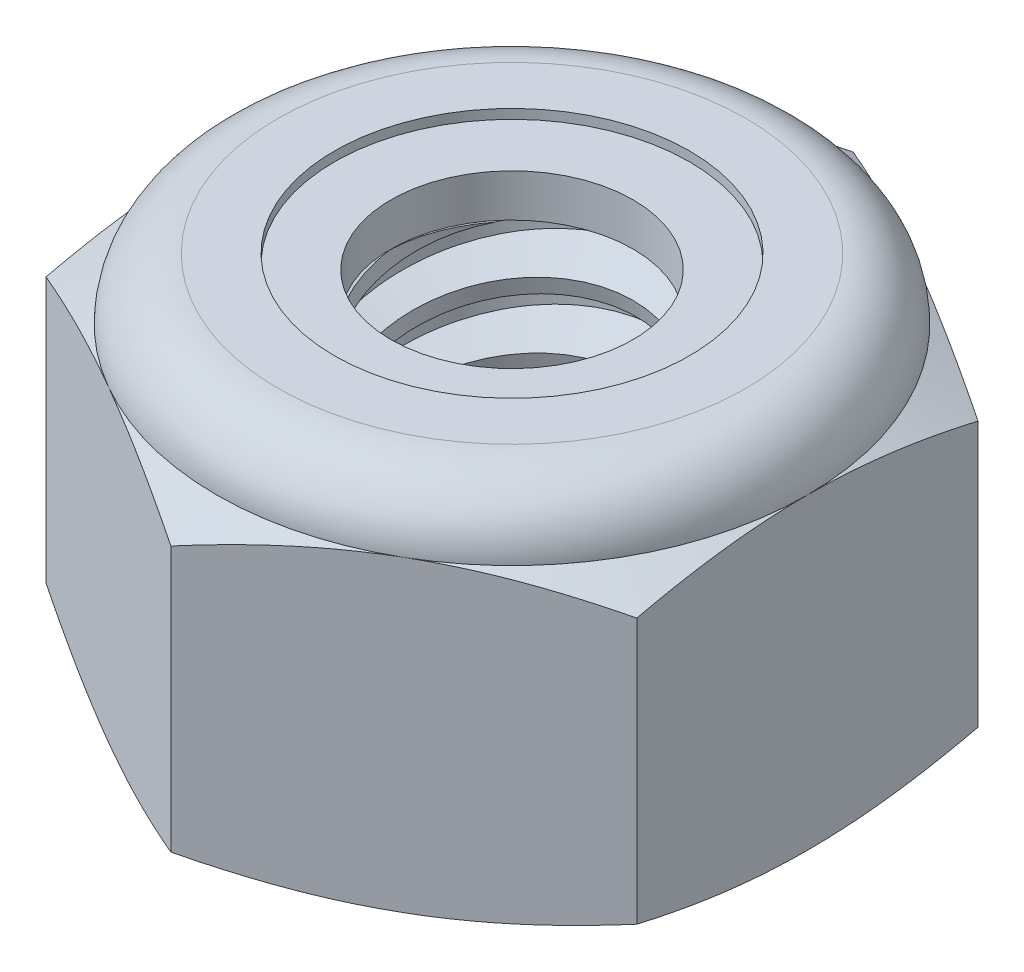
from build123d import *

# Parameters (mm, degrees)
EXTRUDE1_DEPTH      = 5.953125
SKETCH2_W           = 2.413
SKETCH2_H           = 5.953125
LPATTERN1_COUNT     = 6
LPATTERN1_PITCH     = 1.058333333
LPATTERN1_COL_COUNT = 2
LPATTERN1_COL_PITCH = 1.058333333


with BuildPart() as part:
    # Sketch1 → Extrude1 (new body)
    with BuildSketch(Plane(origin=(0, 0, 0), x_dir=(1, 0, 0), z_dir=(0, 1, 0))):
        Polygon((0, 5.499261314), (-4.7625, 2.749630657), (-4.7625, -2.749630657), (0, -5.499261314), (4.7625, -2.749630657), (4.7625, 2.749630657), align=None)
    extrude(amount=EXTRUDE1_DEPTH)

    # Sketch4 → Cut-Revolve2 (revolve, cut)
    with BuildSketch(Plane(origin=(0, 0, 0), x_dir=(0, 0, -1), z_dir=(1, 0, 0)), mode=Mode.PRIVATE) as cut_revolve2_sk:
        Polygon((0, 5.953125), (2.413, 5.953125), (1.952639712, 5.738455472), (1.952639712, 0.214669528), (2.413, 0), (0, 0), align=None)
    revolve(cut_revolve2_sk.sketch.rotate(Axis((0, 5.953125, 0), (0, 1, 0)), 47.786997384), axis=Axis((0, 5.953125, 0), (0, 1, 0)), mode=Mode.SUBTRACT)


with BuildPart() as body_2:
    # Sketch2 → Revolve1 (revolve)
    with BuildSketch(Plane(origin=(0, 0, 0), x_dir=(0, 0, -1), z_dir=(1, 0, 0))):
        with Locations((1.2065, 2.9765625)):
            Rectangle(SKETCH2_W, SKETCH2_H)
    revolve(axis=Axis((0, -2.413, 0), (0, 1, 0)))

    # Sketch3 → Cut-Revolve1 (revolve, cut)
    with BuildSketch(Plane(origin=(0, 0, 0), x_dir=(0, 0, -1), z_dir=(1, 0, 0)), mode=Mode.PRIVATE) as cut_revolve1_sk:
        Polygon((2.441337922, 5.823904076), (2.639703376, 4.919357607), (2.009315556, 5.119703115), (1.952639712, 5.378144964), align=None)
    cut_revolve1 = revolve(cut_revolve1_sk.sketch.rotate(Axis((0, 5.953125, 0.249698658), (0, -0.976788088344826, -0.2142079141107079)), 180), axis=Axis((0, 5.953125, 0.249698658), (0, -0.976788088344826, -0.2142079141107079)), mode=Mode.SUBTRACT)

    # LPattern1: Cut-Revolve1 ×6
    with Locations(*[(0, -i * LPATTERN1_PITCH, 0) for i in range(1, LPATTERN1_COUNT)]):
        add(cut_revolve1, mode=Mode.SUBTRACT)

    # LPattern1 col: Cut-Revolve1 ×2
    with Locations(*[(0, i * LPATTERN1_COL_PITCH, 0) for i in range(1, LPATTERN1_COL_COUNT)]):
        add(cut_revolve1, mode=Mode.SUBTRACT)


with BuildPart() as part_1:
    add(part.part)

    # Combine1: cut body 2
    add(body_2.part, mode=Mode.SUBTRACT)

    # Sketch5 → Cut-Revolve3 (revolve, cut)
    with BuildSketch(Plane(origin=(0, 0, 0), x_dir=(0, 0, -1), z_dir=(1, 0, 0)), mode=Mode.PRIVATE) as cut_revolve3_sk:
        with BuildLine():
            Line((0, 0), (4.7625, 0))
            Line((4.7625, 0), (5.499261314, 0.343557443))
            Line((5.499261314, 0.343557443), (5.499261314, 4.617380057))
            Line((5.499261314, 4.617380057), (4.7625, 4.9609375))
            ThreePointArc((4.7625, 4.9609375), (4.471895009, 5.662520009), (3.7703125, 5.953125))
            Line((3.7703125, 5.953125), (3.7703125, 7.223125))
            Line((3.7703125, 7.223125), (6.769261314, 7.223125))
            Line((6.769261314, 7.223125), (6.769261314, -1.27))
            Line((6.769261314, -1.27), (0, -1.27))
            Line((0, -1.27), (0, 0))
        make_face()
    revolve(cut_revolve3_sk.sketch.rotate(Axis((0, 0, 0), (0, 1, 0)), 47.786997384), axis=Axis((0, 0, 0), (0, 1, 0)), mode=Mode.SUBTRACT)

    # Sketch6 → Cut-Revolve4 (revolve, cut)
    with BuildSketch(Plane(origin=(0, 0, 0), x_dir=(0, 0, -1), z_dir=(1, 0, 0)), mode=Mode.PRIVATE) as cut_revolve4_sk:
        with BuildLine():
            Line((0, 4.9609375), (4.6101, 4.9609375))
            ThreePointArc((4.6101, 4.9609375), (4.364131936, 5.554756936), (3.7703125, 5.800725))
            Line((3.7703125, 5.800725), (2.861476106, 5.800725))
            Line((2.861476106, 5.800725), (2.861476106, 7.223125))
            Line((2.861476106, 7.223125), (0, 7.223125))
            Line((0, 7.223125), (0, 4.9609375))
        make_face()
    revolve(cut_revolve4_sk.sketch.rotate(Axis((0, 7.223125, 0), (0, 1, 0)), 19.898434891), axis=Axis((0, 7.223125, 0), (0, 1, 0)), mode=Mode.SUBTRACT)


with BuildPart() as body_2_2:
    # Sketch7 → Revolve2 (revolve)
    with BuildSketch(Plane(origin=(0, 0, 0), x_dir=(0, 0, -1), z_dir=(1, 0, 0))):
        with BuildLine():
            Line((1.952639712, 5.0371375), (4.530088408, 5.0371375))
            ThreePointArc((4.530088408, 5.0371375), (4.282601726, 5.527175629), (3.7703125, 5.724525))
            Line((3.7703125, 5.724525), (1.952639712, 5.724525))
            Line((1.952639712, 5.724525), (1.952639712, 5.0371375))
        make_face()
    revolve(axis=Axis((0, 5.0371375, 0), (0, 1, 0)))


solid = Compound([part_1.part, body_2_2.part])
